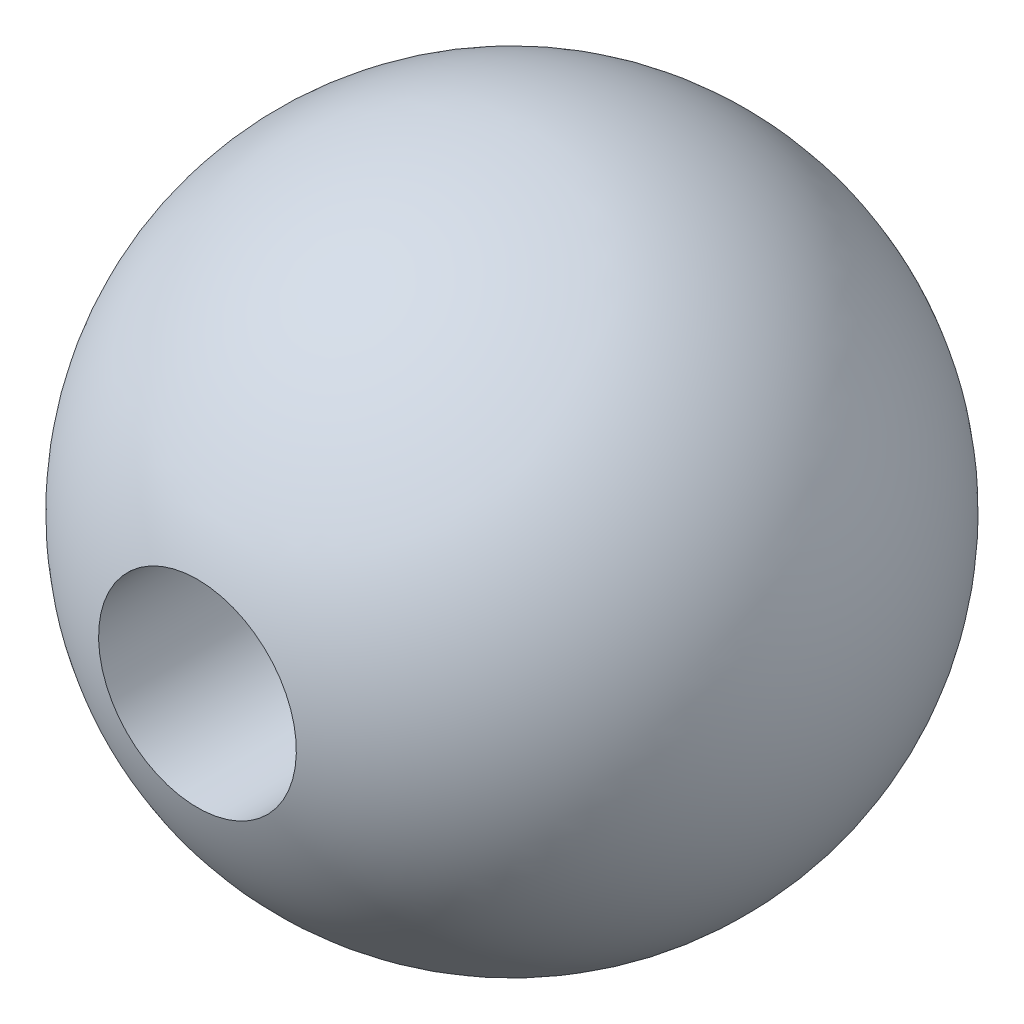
ISO-10303-21;
HEADER;
FILE_DESCRIPTION(('STEP AP214'),'2;1');
FILE_NAME('part.step','',(''),(''),'','','');
FILE_SCHEMA(('AUTOMOTIVE_DESIGN { 1 0 10303 214 1 1 1 1 }'));
ENDSEC;
DATA;
#1=APPLICATION_CONTEXT('core data for automotive mechanical design processes');
#2=APPLICATION_PROTOCOL_DEFINITION('international standard','automotive_design',2000,#1);
#3=PRODUCT_CONTEXT('',#1,'mechanical');
#4=PRODUCT('Part','Part','',(#3));
#5=PRODUCT_RELATED_PRODUCT_CATEGORY('part','',(#4));
#6=PRODUCT_DEFINITION_FORMATION('','',#4);
#7=PRODUCT_DEFINITION_CONTEXT('part definition',#1,'design');
#8=PRODUCT_DEFINITION('design','',#6,#7);
#9=PRODUCT_DEFINITION_SHAPE('','',#8);
#10=(LENGTH_UNIT() NAMED_UNIT(*) SI_UNIT(.MILLI.,.METRE.));
#11=(NAMED_UNIT(*) PLANE_ANGLE_UNIT() SI_UNIT($,.RADIAN.));
#12=(NAMED_UNIT(*) SI_UNIT($,.STERADIAN.) SOLID_ANGLE_UNIT());
#13=UNCERTAINTY_MEASURE_WITH_UNIT(LENGTH_MEASURE(1.E-05),#10,'distance_accuracy_value','');
#14=(GEOMETRIC_REPRESENTATION_CONTEXT(3) GLOBAL_UNCERTAINTY_ASSIGNED_CONTEXT((#13)) GLOBAL_UNIT_ASSIGNED_CONTEXT((#10,
#11,#12)) REPRESENTATION_CONTEXT('',''));
#15=CARTESIAN_POINT('',(0.,0.,0.));
#16=DIRECTION('',(0.,0.,1.));
#17=DIRECTION('',(1.,0.,0.));
#18=AXIS2_PLACEMENT_3D('',#15,#16,#17);
#19=CARTESIAN_POINT('',(0.,0.,0.));
#20=DIRECTION('',(0.,0.,1.));
#21=DIRECTION('',(0.,1.,0.));
#22=AXIS2_PLACEMENT_3D('',#19,#20,#21);
#23=SPHERICAL_SURFACE('',#22,50.);
#24=CARTESIAN_POINT('',(0.,0.,47.6969600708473));
#25=DIRECTION('',(0.,0.,-1.));
#26=DIRECTION('',(-1.,0.,0.));
#27=AXIS2_PLACEMENT_3D('',#24,#25,#26);
#28=CIRCLE('',#27,15.);
#29=CARTESIAN_POINT('',(0.,15.0000000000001,47.6969600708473));
#30=VERTEX_POINT('',#29);
#31=EDGE_CURVE('E10',#30,#30,#28,.T.);
#32=CARTESIAN_POINT('',(0.,0.,-47.6969600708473));
#33=DIRECTION('',(0.,0.,1.));
#34=DIRECTION('',(1.,0.,0.));
#35=AXIS2_PLACEMENT_3D('',#32,#33,#34);
#36=CIRCLE('',#35,15.);
#37=CARTESIAN_POINT('',(0.,15.,-47.6969600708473));
#38=VERTEX_POINT('',#37);
#39=EDGE_CURVE('E49',#38,#38,#36,.T.);
#40=CARTESIAN_POINT('',(0.,15.0000000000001,47.6969600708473));
#41=CARTESIAN_POINT('',(0.,15.62905763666,47.499138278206));
#42=CARTESIAN_POINT('',(0.,16.2541968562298,47.2888583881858));
#43=CARTESIAN_POINT('',(0.,17.4956708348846,46.8437418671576));
#44=CARTESIAN_POINT('',(0.,18.1120055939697,46.6089052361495));
#45=CARTESIAN_POINT('',(0.,19.3349030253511,46.1150346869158));
#46=CARTESIAN_POINT('',(0.,19.9414656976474,45.8560007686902));
#47=CARTESIAN_POINT('',(0.,21.1438703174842,45.3141432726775));
#48=CARTESIAN_POINT('',(0.,21.7397122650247,45.0313196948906));
#49=CARTESIAN_POINT('',(0.,22.919742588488,44.4423249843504));
#50=CARTESIAN_POINT('',(0.,23.5039309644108,44.1361538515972));
#51=CARTESIAN_POINT('',(0.,24.6597398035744,43.5009434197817));
#52=CARTESIAN_POINT('',(0.,25.2313602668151,43.1719041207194));
#53=CARTESIAN_POINT('',(0.,26.3611385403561,42.491472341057));
#54=CARTESIAN_POINT('',(0.,26.9192963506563,42.140079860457));
#55=CARTESIAN_POINT('',(0.,28.0212756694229,41.4154917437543));
#56=CARTESIAN_POINT('',(0.,28.5650971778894,41.0422961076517));
#57=CARTESIAN_POINT('',(0.,29.6375526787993,40.2746858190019));
#58=CARTESIAN_POINT('',(0.,30.1661866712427,39.8802711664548));
#59=CARTESIAN_POINT('',(0.,31.2074396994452,39.0708402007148));
#60=CARTESIAN_POINT('',(0.,31.7200587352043,38.6558238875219));
#61=CARTESIAN_POINT('',(0.,32.7284794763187,37.8058392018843));
#62=CARTESIAN_POINT('',(0.,33.2242811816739,37.3708708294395));
#63=CARTESIAN_POINT('',(0.,34.1982912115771,36.4816628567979));
#64=CARTESIAN_POINT('',(0.,34.676499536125,36.0274232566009));
#65=CARTESIAN_POINT('',(0.,35.6145742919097,35.1003838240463));
#66=CARTESIAN_POINT('',(0.,36.0744407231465,34.6275839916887));
#67=CARTESIAN_POINT('',(0.,36.9751118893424,33.6641641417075));
#68=CARTESIAN_POINT('',(0.,37.4159166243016,33.1735441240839));
#69=CARTESIAN_POINT('',(0.,38.2777744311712,32.1752518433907));
#70=CARTESIAN_POINT('',(0.,38.6988275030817,31.6675795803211));
#71=CARTESIAN_POINT('',(0.,39.5205229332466,30.6359774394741));
#72=CARTESIAN_POINT('',(0.,39.921165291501,30.1120475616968));
#73=CARTESIAN_POINT('',(0.,40.7014121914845,29.0487502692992));
#74=CARTESIAN_POINT('',(0.,41.0810167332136,28.509382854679));
#75=CARTESIAN_POINT('',(0.,41.8185938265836,27.4160547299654));
#76=CARTESIAN_POINT('',(0.,42.1765663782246,26.8620940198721));
#77=CARTESIAN_POINT('',(0.,42.8703191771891,25.740446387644));
#78=CARTESIAN_POINT('',(0.,43.2060994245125,25.1727594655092));
#79=CARTESIAN_POINT('',(0.,43.8549420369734,24.0245479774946));
#80=CARTESIAN_POINT('',(0.,44.168004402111,23.4440234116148));
#81=CARTESIAN_POINT('',(0.,44.7709212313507,22.2710452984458));
#82=CARTESIAN_POINT('',(0.,45.0607756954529,21.6785917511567));
#83=CARTESIAN_POINT('',(0.,45.6168230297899,20.4826830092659));
#84=CARTESIAN_POINT('',(0.,45.8830159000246,19.8792278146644));
#85=CARTESIAN_POINT('',(0.,46.3913233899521,18.6622603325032));
#86=CARTESIAN_POINT('',(0.,46.6334380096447,18.0487480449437));
#87=CARTESIAN_POINT('',(0.,47.0932100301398,16.8126266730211));
#88=CARTESIAN_POINT('',(0.,47.3108674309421,16.190017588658));
#89=CARTESIAN_POINT('',(0.,47.7213843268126,14.9366771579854));
#90=CARTESIAN_POINT('',(0.,47.9142438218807,14.3059458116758));
#91=CARTESIAN_POINT('',(0.,48.2748630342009,13.0373481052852));
#92=CARTESIAN_POINT('',(0.,48.4426227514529,12.3994817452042));
#93=CARTESIAN_POINT('',(0.,48.7527798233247,11.1176124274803));
#94=CARTESIAN_POINT('',(0.,48.8951771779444,10.4736094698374));
#95=CARTESIAN_POINT('',(0.,49.1543866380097,9.18047497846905));
#96=CARTESIAN_POINT('',(0.,49.2711987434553,8.53134344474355));
#97=CARTESIAN_POINT('',(0.,49.4790548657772,7.22896785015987));
#98=CARTESIAN_POINT('',(0.,49.5700988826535,6.5757237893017));
#99=CARTESIAN_POINT('',(0.,49.7262763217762,5.26614562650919));
#100=CARTESIAN_POINT('',(0.,49.7914097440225,4.60981152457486));
#101=CARTESIAN_POINT('',(0.,49.8956640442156,3.29508060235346));
#102=CARTESIAN_POINT('',(0.,49.9347849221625,2.63668378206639));
#103=CARTESIAN_POINT('',(0.,49.9869529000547,1.31885797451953));
#104=CARTESIAN_POINT('',(0.,50.,0.659428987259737));
#105=CARTESIAN_POINT('',(0.,50.,-0.659428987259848));
#106=CARTESIAN_POINT('',(0.,49.9869529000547,-1.31885797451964));
#107=CARTESIAN_POINT('',(0.,49.9347849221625,-2.6366837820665));
#108=CARTESIAN_POINT('',(0.,49.8956640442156,-3.29508060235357));
#109=CARTESIAN_POINT('',(0.,49.7914097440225,-4.60981152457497));
#110=CARTESIAN_POINT('',(0.,49.7262763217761,-5.2661456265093));
#111=CARTESIAN_POINT('',(0.,49.5700988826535,-6.57572378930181));
#112=CARTESIAN_POINT('',(0.,49.4790548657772,-7.22896785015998));
#113=CARTESIAN_POINT('',(0.,49.2711987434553,-8.53134344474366));
#114=CARTESIAN_POINT('',(0.,49.1543866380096,-9.18047497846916));
#115=CARTESIAN_POINT('',(0.,48.8951771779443,-10.4736094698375));
#116=CARTESIAN_POINT('',(0.,48.7527798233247,-11.1176124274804));
#117=CARTESIAN_POINT('',(0.,48.4426227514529,-12.3994817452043));
#118=CARTESIAN_POINT('',(0.,48.2748630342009,-13.0373481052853));
#119=CARTESIAN_POINT('',(0.,47.9142438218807,-14.3059458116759));
#120=CARTESIAN_POINT('',(0.,47.7213843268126,-14.9366771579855));
#121=CARTESIAN_POINT('',(0.,47.3108674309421,-16.1900175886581));
#122=CARTESIAN_POINT('',(0.,47.0932100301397,-16.8126266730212));
#123=CARTESIAN_POINT('',(0.,46.6334380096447,-18.0487480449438));
#124=CARTESIAN_POINT('',(0.,46.391323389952,-18.6622603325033));
#125=CARTESIAN_POINT('',(0.,45.8830159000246,-19.8792278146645));
#126=CARTESIAN_POINT('',(0.,45.6168230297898,-20.482683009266));
#127=CARTESIAN_POINT('',(0.,45.0607756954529,-21.6785917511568));
#128=CARTESIAN_POINT('',(0.,44.7709212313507,-22.2710452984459));
#129=CARTESIAN_POINT('',(0.,44.1680044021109,-23.4440234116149));
#130=CARTESIAN_POINT('',(0.,43.8549420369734,-24.0245479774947));
#131=CARTESIAN_POINT('',(0.,43.2060994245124,-25.1727594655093));
#132=CARTESIAN_POINT('',(0.,42.870319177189,-25.7404463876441));
#133=CARTESIAN_POINT('',(0.,42.1765663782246,-26.8620940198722));
#134=CARTESIAN_POINT('',(0.,41.8185938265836,-27.4160547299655));
#135=CARTESIAN_POINT('',(0.,41.0810167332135,-28.5093828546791));
#136=CARTESIAN_POINT('',(0.,40.7014121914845,-29.0487502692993));
#137=CARTESIAN_POINT('',(0.,39.921165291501,-30.1120475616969));
#138=CARTESIAN_POINT('',(0.,39.5205229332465,-30.6359774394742));
#139=CARTESIAN_POINT('',(0.,38.6988275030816,-31.6675795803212));
#140=CARTESIAN_POINT('',(0.,38.2777744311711,-32.1752518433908));
#141=CARTESIAN_POINT('',(0.,37.4159166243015,-33.173544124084));
#142=CARTESIAN_POINT('',(0.,36.9751118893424,-33.6641641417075));
#143=CARTESIAN_POINT('',(0.,36.0744407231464,-34.6275839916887));
#144=CARTESIAN_POINT('',(0.,35.6145742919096,-35.1003838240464));
#145=CARTESIAN_POINT('',(0.,34.6764995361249,-36.027423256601));
#146=CARTESIAN_POINT('',(0.,34.198291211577,-36.4816628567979));
#147=CARTESIAN_POINT('',(0.,33.2242811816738,-37.3708708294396));
#148=CARTESIAN_POINT('',(0.,32.7284794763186,-37.8058392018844));
#149=CARTESIAN_POINT('',(0.,31.7200587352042,-38.655823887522));
#150=CARTESIAN_POINT('',(0.,31.2074396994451,-39.0708402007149));
#151=CARTESIAN_POINT('',(0.,30.1661866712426,-39.8802711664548));
#152=CARTESIAN_POINT('',(0.,29.6375526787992,-40.2746858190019));
#153=CARTESIAN_POINT('',(0.,28.5650971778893,-41.0422961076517));
#154=CARTESIAN_POINT('',(0.,28.0212756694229,-41.4154917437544));
#155=CARTESIAN_POINT('',(0.,26.9192963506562,-42.1400798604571));
#156=CARTESIAN_POINT('',(0.,26.361138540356,-42.4914723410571));
#157=CARTESIAN_POINT('',(0.,25.231360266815,-43.1719041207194));
#158=CARTESIAN_POINT('',(0.,24.6597398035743,-43.5009434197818));
#159=CARTESIAN_POINT('',(0.,23.5039309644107,-44.1361538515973));
#160=CARTESIAN_POINT('',(0.,22.9197425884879,-44.4423249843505));
#161=CARTESIAN_POINT('',(0.,21.7397122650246,-45.0313196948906));
#162=CARTESIAN_POINT('',(0.,21.1438703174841,-45.3141432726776));
#163=CARTESIAN_POINT('',(0.,19.9414656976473,-45.8560007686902));
#164=CARTESIAN_POINT('',(0.,19.334903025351,-46.1150346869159));
#165=CARTESIAN_POINT('',(0.,18.1120055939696,-46.6089052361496));
#166=CARTESIAN_POINT('',(0.,17.4956708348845,-46.8437418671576));
#167=CARTESIAN_POINT('',(0.,16.2541968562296,-47.2888583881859));
#168=CARTESIAN_POINT('',(0.,15.6290576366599,-47.4991382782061));
#169=CARTESIAN_POINT('',(0.,15.,-47.6969600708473));
#170=B_SPLINE_CURVE_WITH_KNOTS('',3,(#40,#41,#42,#43,#44,#45,#46,#47,#48,#49,#50,#51,#52,#53,
#54,#55,#56,#57,#58,#59,#60,#61,#62,#63,#64,#65,#66,#67,#68,#69,#70,#71,#72,#73,#74,#75,#76,#77,
#78,#79,#80,#81,#82,#83,#84,#85,#86,#87,#88,#89,#90,#91,#92,#93,#94,#95,#96,#97,#98,#99,#100,
#101,#102,#103,#104,#105,#106,#107,#108,#109,#110,#111,#112,#113,#114,#115,#116,#117,#118,#119,
#120,#121,#122,#123,#124,#125,#126,#127,#128,#129,#130,#131,#132,#133,#134,#135,#136,#137,#138,
#139,#140,#141,#142,#143,#144,#145,#146,#147,#148,#149,#150,#151,#152,#153,#154,#155,#156,#157,
#158,#159,#160,#161,#162,#163,#164,#165,#166,#167,#168,#169),.UNSPECIFIED.,.F.,.F.,(4,2,2,2,2,2,
2,2,2,2,2,2,2,2,2,2,2,2,2,2,2,2,2,2,2,2,2,2,2,2,2,2,2,2,2,2,2,2,2,2,2,2,2,2,2,2,2,2,2,2,2,2,2,2,
2,2,2,2,2,2,2,2,2,2,4),(0.,1.97815795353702,3.95631590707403,5.93447386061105,7.91263181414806,
9.89078976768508,11.8689477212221,13.8471056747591,15.8252636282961,17.8034215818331,
19.7815795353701,21.7597374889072,23.7378954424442,25.7160533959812,27.6942113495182,
29.6723693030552,31.6505272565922,33.6286852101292,35.6068431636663,37.5850011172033,
39.5631590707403,41.5413170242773,43.5194749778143,45.4976329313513,47.4757908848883,
49.4539488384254,51.4321067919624,53.4102647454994,55.3884226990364,57.3665806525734,
59.3447386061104,61.3228965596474,63.3010545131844,65.2792124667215,67.2573704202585,
69.2355283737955,71.2136863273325,73.1918442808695,75.1700022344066,77.1481601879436,
79.1263181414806,81.1044760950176,83.0826340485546,85.0607920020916,87.0389499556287,
89.0171079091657,90.9952658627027,92.9734238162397,94.9515817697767,96.9297397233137,
98.9078976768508,100.886055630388,102.864213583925,104.842371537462,106.820529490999,
108.798687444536,110.776845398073,112.75500335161,114.733161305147,116.711319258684,
118.689477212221,120.667635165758,122.645793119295,124.623951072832,126.602109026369),.UNSPECIFIED.);
#171=EDGE_CURVE('BSEAM42',#30,#38,#170,.T.);
#172=ORIENTED_EDGE('',*,*,#31,.T.);
#173=ORIENTED_EDGE('',*,*,#39,.T.);
#174=ORIENTED_EDGE('',*,*,#171,.T.);
#175=ORIENTED_EDGE('',*,*,#171,.F.);
#176=EDGE_LOOP('',(#172,#174,#173,#175));
#177=FACE_BOUND('',#176,.T.);
#178=ADVANCED_FACE('F42',(#177),#23,.T.);
#179=CARTESIAN_POINT('',(0.,0.,-50.));
#180=DIRECTION('',(0.,0.,1.));
#181=DIRECTION('',(1.,0.,0.));
#182=AXIS2_PLACEMENT_3D('',#179,#180,#181);
#183=CYLINDRICAL_SURFACE('',#182,15.);
#184=ORIENTED_EDGE('',*,*,#39,.F.);
#185=EDGE_LOOP('',(#184));
#186=FACE_BOUND('',#185,.T.);
#187=ORIENTED_EDGE('',*,*,#31,.F.);
#188=EDGE_LOOP('',(#187));
#189=FACE_BOUND('',#188,.T.);
#190=ADVANCED_FACE('F57',(#186,#189),#183,.F.);
#191=CLOSED_SHELL('',(#178,#190));
#192=MANIFOLD_SOLID_BREP('B2',#191);
#193=ADVANCED_BREP_SHAPE_REPRESENTATION('',(#18,#192),#14);
#194=SHAPE_DEFINITION_REPRESENTATION(#9,#193);
ENDSEC;
END-ISO-10303-21;
